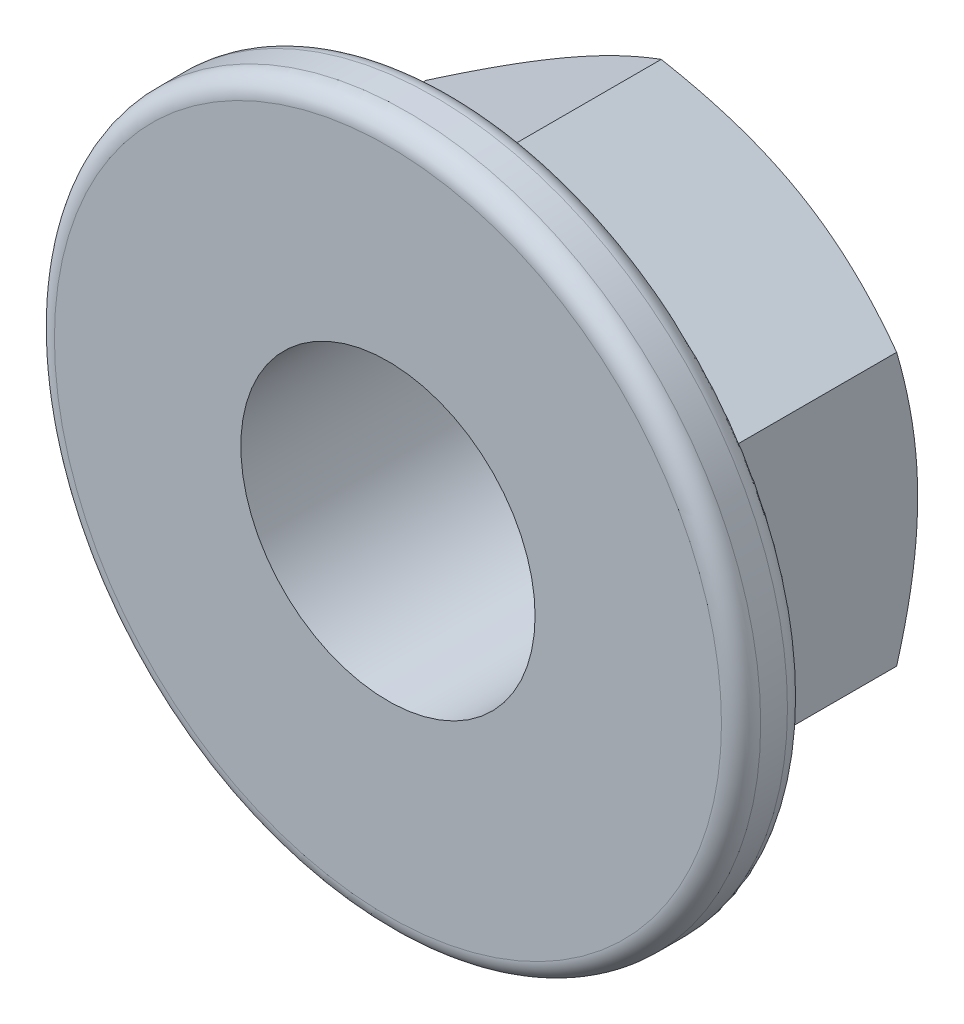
from build123d import *

# Parameters (mm, degrees)
BASE_EXTRUSION_DEPTH    = 5
ESQUISSE3_R             = 2.5
ENL_V_MAT_EXTRU_1_DEPTH = 5


with BuildPart() as part:
    # Esquisse1 → Base-Extrusion (new body)
    with BuildSketch(Plane.XY):
        Polygon((4, -2.309401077), (4, 2.309401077), (0, 4.618802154), (-4, 2.309401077), (-4, -2.309401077), (0, -4.618802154), align=None)
    extrude(amount=-BASE_EXTRUSION_DEPTH)

    # Esquisse2 → Enl_vement de mati_re-R_volution1 (revolve, cut)
    with BuildSketch(Plane(origin=(0, 0, 0), x_dir=(1, 0, 0), z_dir=(0, 1, 0))):
        Polygon((-4, 5), (-12.660254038, 5), (-12.660254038, 0), align=None)
    revolve(axis=Axis((0, 0, -5), (0, 0, 1)), mode=Mode.SUBTRACT)

    # Esquisse3 → Enl_v. mat.-Extru.1 (cut)
    with BuildSketch(Plane.XY):
        Circle(ESQUISSE3_R)
    extrude(amount=-ENL_V_MAT_EXTRU_1_DEPTH, mode=Mode.SUBTRACT)

    # Esquisse4 → Boss.-R_vol.1 (revolve)
    with BuildSketch(Plane(origin=(0, 0, 0), x_dir=(1, 0, 0), z_dir=(0, 1, 0)), mode=Mode.PRIVATE) as boss_r_vol_1_sk:
        with BuildLine():
            Line((-4, 0), (-5.666666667, 0))
            ThreePointArc((-5.666666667, 0), (-5.902368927, 0.097631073), (-6, 0.333333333))
            Line((-6, 0.333333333), (-6, 0.787643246))
            ThreePointArc((-6, 0.787643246), (-5.947797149, 0.966743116), (-5.807539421, 1.089745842))
            Line((-5.807539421, 1.089745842), (-4, 1.932615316))
            Line((-4, 1.932615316), (-4, 0))
        make_face()
    revolve(boss_r_vol_1_sk.sketch.rotate(Axis((0, 0, -1.932615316), (0, 0, 1)), 180), axis=Axis((0, 0, -1.932615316), (0, 0, 1)))


solid = part.part
